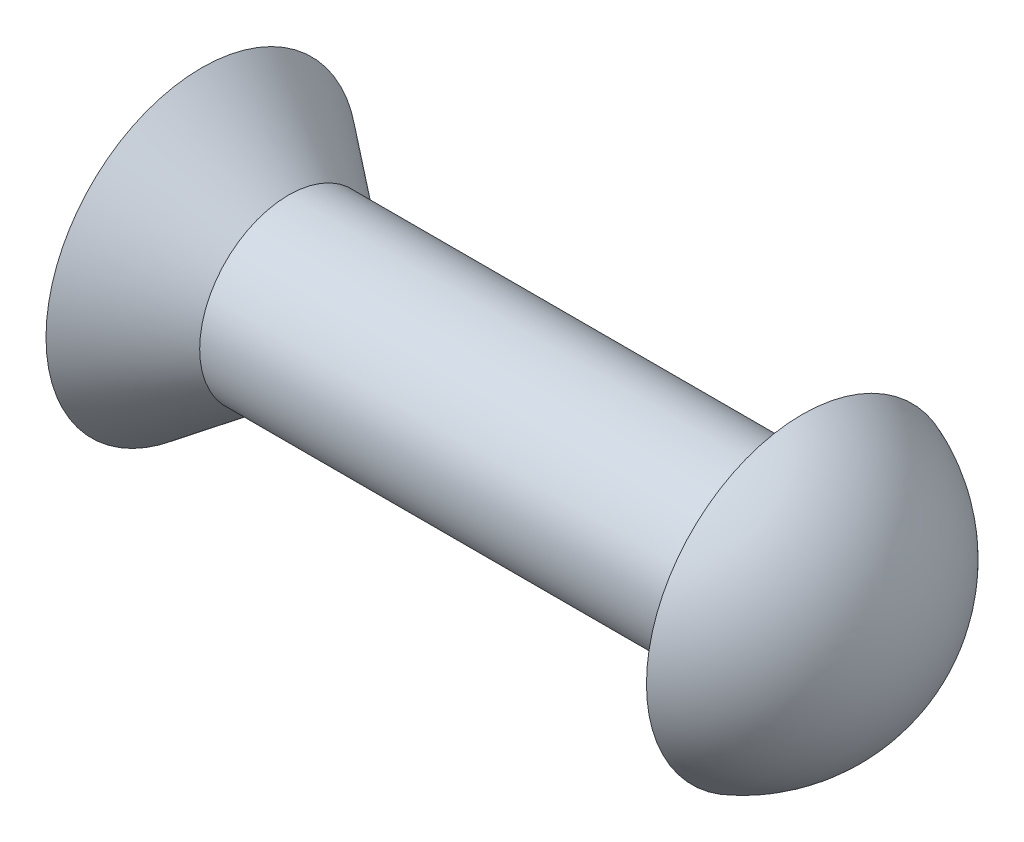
ISO-10303-21;
HEADER;
FILE_DESCRIPTION(('STEP AP214'),'2;1');
FILE_NAME('part.step','',(''),(''),'','','');
FILE_SCHEMA(('AUTOMOTIVE_DESIGN { 1 0 10303 214 1 1 1 1 }'));
ENDSEC;
DATA;
#1=APPLICATION_CONTEXT('core data for automotive mechanical design processes');
#2=APPLICATION_PROTOCOL_DEFINITION('international standard','automotive_design',2000,#1);
#3=PRODUCT_CONTEXT('',#1,'mechanical');
#4=PRODUCT('Part','Part','',(#3));
#5=PRODUCT_RELATED_PRODUCT_CATEGORY('part','',(#4));
#6=PRODUCT_DEFINITION_FORMATION('','',#4);
#7=PRODUCT_DEFINITION_CONTEXT('part definition',#1,'design');
#8=PRODUCT_DEFINITION('design','',#6,#7);
#9=PRODUCT_DEFINITION_SHAPE('','',#8);
#10=(LENGTH_UNIT() NAMED_UNIT(*) SI_UNIT(.MILLI.,.METRE.));
#11=(NAMED_UNIT(*) PLANE_ANGLE_UNIT() SI_UNIT($,.RADIAN.));
#12=(NAMED_UNIT(*) SI_UNIT($,.STERADIAN.) SOLID_ANGLE_UNIT());
#13=UNCERTAINTY_MEASURE_WITH_UNIT(LENGTH_MEASURE(1.E-05),#10,'distance_accuracy_value','');
#14=(GEOMETRIC_REPRESENTATION_CONTEXT(3) GLOBAL_UNCERTAINTY_ASSIGNED_CONTEXT((#13)) GLOBAL_UNIT_ASSIGNED_CONTEXT((#10,
#11,#12)) REPRESENTATION_CONTEXT('',''));
#15=CARTESIAN_POINT('',(0.,0.,0.));
#16=DIRECTION('',(0.,0.,1.));
#17=DIRECTION('',(1.,0.,0.));
#18=AXIS2_PLACEMENT_3D('',#15,#16,#17);
#19=CARTESIAN_POINT('',(-23.0903238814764,0.,0.));
#20=DIRECTION('',(-1.,0.,0.));
#21=DIRECTION('',(0.,0.,1.));
#22=AXIS2_PLACEMENT_3D('',#19,#20,#21);
#23=CONICAL_SURFACE('',#22,4.,0.654498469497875);
#24=CARTESIAN_POINT('',(-27.,0.,0.));
#25=DIRECTION('',(-1.,0.,0.));
#26=DIRECTION('',(0.,0.,1.));
#27=AXIS2_PLACEMENT_3D('',#24,#25,#26);
#28=CIRCLE('',#27,7.);
#29=CARTESIAN_POINT('',(-27.,0.,7.));
#30=VERTEX_POINT('',#29);
#31=EDGE_CURVE('E11',#30,#30,#28,.T.);
#32=ORIENTED_EDGE('',*,*,#31,.F.);
#33=EDGE_LOOP('',(#32));
#34=FACE_BOUND('',#33,.T.);
#35=CARTESIAN_POINT('',(-23.0903238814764,0.,0.));
#36=DIRECTION('',(-1.,0.,0.));
#37=DIRECTION('',(0.,0.,1.));
#38=AXIS2_PLACEMENT_3D('',#35,#36,#37);
#39=CIRCLE('',#38,4.);
#40=CARTESIAN_POINT('',(-23.0903238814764,0.,4.));
#41=VERTEX_POINT('',#40);
#42=EDGE_CURVE('E38',#41,#41,#39,.T.);
#43=ORIENTED_EDGE('',*,*,#42,.T.);
#44=EDGE_LOOP('',(#43));
#45=FACE_BOUND('',#44,.T.);
#46=ADVANCED_FACE('F32',(#34,#45),#23,.T.);
#47=CARTESIAN_POINT('',(-27.,7.,0.));
#48=DIRECTION('',(1.,0.,0.));
#49=DIRECTION('',(0.,0.,-1.));
#50=AXIS2_PLACEMENT_3D('',#47,#48,#49);
#51=PLANE('',#50);
#52=ORIENTED_EDGE('',*,*,#31,.T.);
#53=EDGE_LOOP('',(#52));
#54=FACE_BOUND('',#53,.T.);
#55=ADVANCED_FACE('F54',(#54),#51,.F.);
#56=CARTESIAN_POINT('',(-34.,0.,0.));
#57=DIRECTION('',(-1.,0.,0.));
#58=DIRECTION('',(0.,0.,1.));
#59=AXIS2_PLACEMENT_3D('',#56,#57,#58);
#60=CYLINDRICAL_SURFACE('',#59,4.);
#61=ORIENTED_EDGE('',*,*,#42,.F.);
#62=EDGE_LOOP('',(#61));
#63=FACE_BOUND('',#62,.T.);
#64=CARTESIAN_POINT('',(0.,0.,0.));
#65=DIRECTION('',(1.,0.,0.));
#66=DIRECTION('',(0.,0.,-1.));
#67=AXIS2_PLACEMENT_3D('',#64,#65,#66);
#68=CIRCLE('',#67,4.);
#69=CARTESIAN_POINT('',(0.,0.,-4.));
#70=VERTEX_POINT('',#69);
#71=EDGE_CURVE('E65',#70,#70,#68,.T.);
#72=ORIENTED_EDGE('',*,*,#71,.F.);
#73=EDGE_LOOP('',(#72));
#74=FACE_BOUND('',#73,.T.);
#75=ADVANCED_FACE('F49',(#63,#74),#60,.T.);
#76=CARTESIAN_POINT('',(0.,0.,0.));
#77=DIRECTION('',(1.,0.,0.));
#78=DIRECTION('',(0.,0.,-1.));
#79=AXIS2_PLACEMENT_3D('',#76,#77,#78);
#80=PLANE('',#79);
#81=ORIENTED_EDGE('',*,*,#71,.T.);
#82=EDGE_LOOP('',(#81));
#83=FACE_BOUND('',#82,.T.);
#84=CARTESIAN_POINT('',(0.,0.,0.));
#85=DIRECTION('',(-1.,0.,0.));
#86=DIRECTION('',(0.,0.,1.));
#87=AXIS2_PLACEMENT_3D('',#84,#85,#86);
#88=CIRCLE('',#87,7.);
#89=CARTESIAN_POINT('',(0.,0.,7.));
#90=VERTEX_POINT('',#89);
#91=EDGE_CURVE('E67',#90,#90,#88,.T.);
#92=ORIENTED_EDGE('',*,*,#91,.T.);
#93=EDGE_LOOP('',(#92));
#94=FACE_BOUND('',#93,.T.);
#95=ADVANCED_FACE('F43',(#83,#94),#80,.F.);
#96=CARTESIAN_POINT('',(-2.69999945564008,0.,0.00285751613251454));
#97=DIRECTION('',(0.,-1.,0.));
#98=DIRECTION('',(0.,0.,1.));
#99=AXIS2_PLACEMENT_3D('',#96,#97,#98);
#100=CIRCLE('',#99,7.5);
#101=TRIMMED_CURVE('',#100,(PARAMETER_VALUE(-1.57117732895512)),
(PARAMETER_VALUE(1.57117732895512)),.T.,.PARAMETER.);
#102=CARTESIAN_POINT('',(-2.69999945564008,0.,0.));
#103=DIRECTION('',(-1.,0.,0.));
#104=AXIS1_PLACEMENT('',#102,#103);
#105=SURFACE_OF_REVOLUTION('',#101,#104);
#106=ORIENTED_EDGE('',*,*,#91,.F.);
#107=EDGE_LOOP('',(#106));
#108=FACE_BOUND('',#107,.T.);
#109=CARTESIAN_POINT('',(4.8,0.,0.));
#110=VERTEX_POINT('',#109);
#111=VERTEX_LOOP('',#110);
#112=FACE_BOUND('',#111,.T.);
#113=ADVANCED_FACE('F41',(#108,#112),#105,.T.);
#114=CLOSED_SHELL('',(#46,#55,#75,#95,#113));
#115=MANIFOLD_SOLID_BREP('B2',#114);
#116=ADVANCED_BREP_SHAPE_REPRESENTATION('',(#18,#115),#14);
#117=SHAPE_DEFINITION_REPRESENTATION(#9,#116);
ENDSEC;
END-ISO-10303-21;
